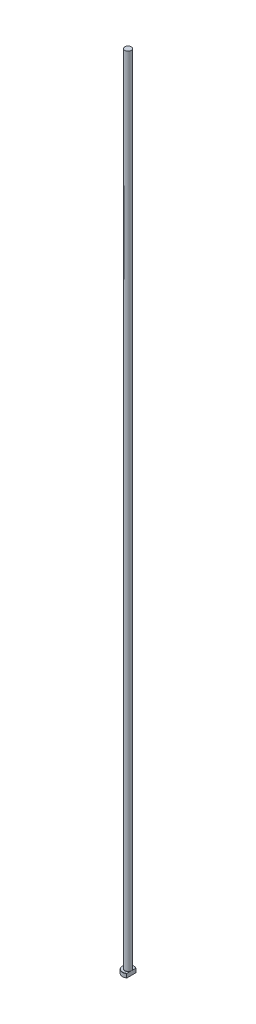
ISO-10303-21;
HEADER;
FILE_DESCRIPTION(('STEP AP214'),'2;1');
FILE_NAME('part.step','',(''),(''),'','','');
FILE_SCHEMA(('AUTOMOTIVE_DESIGN { 1 0 10303 214 1 1 1 1 }'));
ENDSEC;
DATA;
#1=APPLICATION_CONTEXT('core data for automotive mechanical design processes');
#2=APPLICATION_PROTOCOL_DEFINITION('international standard','automotive_design',2000,#1);
#3=PRODUCT_CONTEXT('',#1,'mechanical');
#4=PRODUCT('Part','Part','',(#3));
#5=PRODUCT_RELATED_PRODUCT_CATEGORY('part','',(#4));
#6=PRODUCT_DEFINITION_FORMATION('','',#4);
#7=PRODUCT_DEFINITION_CONTEXT('part definition',#1,'design');
#8=PRODUCT_DEFINITION('design','',#6,#7);
#9=PRODUCT_DEFINITION_SHAPE('','',#8);
#10=(LENGTH_UNIT() NAMED_UNIT(*) SI_UNIT(.MILLI.,.METRE.));
#11=(NAMED_UNIT(*) PLANE_ANGLE_UNIT() SI_UNIT($,.RADIAN.));
#12=(NAMED_UNIT(*) SI_UNIT($,.STERADIAN.) SOLID_ANGLE_UNIT());
#13=UNCERTAINTY_MEASURE_WITH_UNIT(LENGTH_MEASURE(1.E-05),#10,'distance_accuracy_value','');
#14=(GEOMETRIC_REPRESENTATION_CONTEXT(3) GLOBAL_UNCERTAINTY_ASSIGNED_CONTEXT((#13)) GLOBAL_UNIT_ASSIGNED_CONTEXT((#10,
#11,#12)) REPRESENTATION_CONTEXT('',''));
#15=CARTESIAN_POINT('',(0.,0.,0.));
#16=DIRECTION('',(0.,0.,1.));
#17=DIRECTION('',(1.,0.,0.));
#18=AXIS2_PLACEMENT_3D('',#15,#16,#17);
#19=CARTESIAN_POINT('',(0.,0.,0.));
#20=DIRECTION('',(0.,-1.,0.));
#21=DIRECTION('',(0.,0.,-1.));
#22=AXIS2_PLACEMENT_3D('',#19,#20,#21);
#23=PLANE('',#22);
#24=CARTESIAN_POINT('',(0.,0.,0.));
#25=DIRECTION('',(0.,-1.,0.));
#26=DIRECTION('',(0.,0.,-1.));
#27=AXIS2_PLACEMENT_3D('',#24,#25,#26);
#28=CIRCLE('',#27,6.79999999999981);
#29=CARTESIAN_POINT('',(3.99999999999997,0.,5.49909083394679));
#30=VERTEX_POINT('',#29);
#31=CARTESIAN_POINT('',(3.99999999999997,0.,-5.49909083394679));
#32=VERTEX_POINT('',#31);
#33=EDGE_CURVE('E98',#30,#32,#28,.T.);
#34=ORIENTED_EDGE('',*,*,#33,.T.);
#35=DIRECTION('',(0.,0.,1.));
#36=VECTOR('',#35,1.);
#37=CARTESIAN_POINT('',(3.99999999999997,0.,-5.74456264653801));
#38=LINE('',#37,#36);
#39=EDGE_CURVE('E83',#32,#30,#38,.T.);
#40=ORIENTED_EDGE('',*,*,#39,.T.);
#41=EDGE_LOOP('',(#34,#40));
#42=FACE_BOUND('',#41,.T.);
#43=ADVANCED_FACE('F32',(#42),#23,.T.);
#44=CARTESIAN_POINT('',(0.,259.958771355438,0.));
#45=DIRECTION('',(0.,1.,0.));
#46=DIRECTION('',(0.,0.,1.));
#47=AXIS2_PLACEMENT_3D('',#44,#45,#46);
#48=CYLINDRICAL_SURFACE('',#47,6.99999999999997);
#49=CARTESIAN_POINT('',(0.,4.80000000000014,0.));
#50=DIRECTION('',(0.,1.,0.));
#51=DIRECTION('',(0.,0.,1.));
#52=AXIS2_PLACEMENT_3D('',#49,#50,#51);
#53=CIRCLE('',#52,6.99999999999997);
#54=CARTESIAN_POINT('',(3.99999999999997,4.80000000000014,5.74456264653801));
#55=VERTEX_POINT('',#54);
#56=CARTESIAN_POINT('',(3.99999999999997,4.80000000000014,-5.74456264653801));
#57=VERTEX_POINT('',#56);
#58=EDGE_CURVE('E104',#55,#57,#53,.F.);
#59=ORIENTED_EDGE('',*,*,#58,.T.);
#60=DIRECTION('',(0.,-1.,0.));
#61=VECTOR('',#60,1.);
#62=CARTESIAN_POINT('',(3.99999999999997,1000.,-5.74456264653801));
#63=LINE('',#62,#61);
#64=CARTESIAN_POINT('',(3.99999999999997,0.200000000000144,-5.74456264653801));
#65=VERTEX_POINT('',#64);
#66=EDGE_CURVE('E183',#57,#65,#63,.T.);
#67=ORIENTED_EDGE('',*,*,#66,.T.);
#68=CARTESIAN_POINT('',(0.,0.200000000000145,0.));
#69=DIRECTION('',(0.,-1.,0.));
#70=DIRECTION('',(0.,0.,-1.));
#71=AXIS2_PLACEMENT_3D('',#68,#69,#70);
#72=CIRCLE('',#71,6.99999999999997);
#73=CARTESIAN_POINT('',(3.99999999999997,0.200000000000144,5.74456264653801));
#74=VERTEX_POINT('',#73);
#75=EDGE_CURVE('E100',#65,#74,#72,.F.);
#76=ORIENTED_EDGE('',*,*,#75,.T.);
#77=DIRECTION('',(0.,-1.,0.));
#78=VECTOR('',#77,1.);
#79=CARTESIAN_POINT('',(3.99999999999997,1000.,5.74456264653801));
#80=LINE('',#79,#78);
#81=EDGE_CURVE('E93',#55,#74,#80,.T.);
#82=ORIENTED_EDGE('',*,*,#81,.F.);
#83=EDGE_LOOP('',(#59,#67,#76,#82));
#84=FACE_BOUND('',#83,.T.);
#85=ADVANCED_FACE('F158',(#84),#48,.T.);
#86=CARTESIAN_POINT('',(-6.99999999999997,5.,0.));
#87=DIRECTION('',(0.,1.,0.));
#88=DIRECTION('',(0.,0.,1.));
#89=AXIS2_PLACEMENT_3D('',#86,#87,#88);
#90=PLANE('',#89);
#91=CARTESIAN_POINT('',(0.,5.,0.));
#92=DIRECTION('',(0.,1.,0.));
#93=DIRECTION('',(0.,0.,1.));
#94=AXIS2_PLACEMENT_3D('',#91,#92,#93);
#95=CIRCLE('',#94,6.80000000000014);
#96=CARTESIAN_POINT('',(3.99999999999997,5.,-5.49909083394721));
#97=VERTEX_POINT('',#96);
#98=CARTESIAN_POINT('',(3.99999999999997,5.,5.49909083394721));
#99=VERTEX_POINT('',#98);
#100=EDGE_CURVE('E178',#97,#99,#95,.T.);
#101=ORIENTED_EDGE('',*,*,#100,.T.);
#102=DIRECTION('',(0.,0.,-1.));
#103=VECTOR('',#102,1.);
#104=CARTESIAN_POINT('',(3.99999999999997,5.,0.));
#105=LINE('',#104,#103);
#106=CARTESIAN_POINT('',(3.99999999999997,4.99999999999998,1.28062484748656));
#107=VERTEX_POINT('',#106);
#108=EDGE_CURVE('E57',#99,#107,#105,.T.);
#109=ORIENTED_EDGE('',*,*,#108,.T.);
#110=CARTESIAN_POINT('',(0.,5.,0.));
#111=DIRECTION('',(0.,1.,0.));
#112=DIRECTION('',(0.,0.,1.));
#113=AXIS2_PLACEMENT_3D('',#110,#111,#112);
#114=CIRCLE('',#113,4.19999999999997);
#115=CARTESIAN_POINT('',(3.99999999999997,4.99999999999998,-1.28062484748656));
#116=VERTEX_POINT('',#115);
#117=EDGE_CURVE('E107',#107,#116,#114,.F.);
#118=ORIENTED_EDGE('',*,*,#117,.T.);
#119=EDGE_CURVE('E136',#116,#97,#105,.T.);
#120=ORIENTED_EDGE('',*,*,#119,.T.);
#121=EDGE_LOOP('',(#101,#109,#118,#120));
#122=FACE_BOUND('',#121,.T.);
#123=ADVANCED_FACE('F147',(#122),#90,.T.);
#124=CARTESIAN_POINT('',(0.,5.,0.));
#125=DIRECTION('',(0.,-1.,0.));
#126=DIRECTION('',(0.,0.,-1.));
#127=AXIS2_PLACEMENT_3D('',#124,#125,#126);
#128=CONICAL_SURFACE('',#127,6.80000000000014,0.785398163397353);
#129=ORIENTED_EDGE('',*,*,#58,.F.);
#130=CARTESIAN_POINT('',(3.99999999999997,-1.45712845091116,12.6392822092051));
#131=CARTESIAN_POINT('',(3.99999999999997,-1.24364466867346,12.4153556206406));
#132=CARTESIAN_POINT('',(3.99999999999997,-1.0304243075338,12.1911774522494));
#133=CARTESIAN_POINT('',(3.99999999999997,-0.604617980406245,11.7422167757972));
#134=CARTESIAN_POINT('',(3.99999999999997,-0.392032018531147,11.5174342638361));
#135=CARTESIAN_POINT('',(3.99999999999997,0.032462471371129,11.0670952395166));
#136=CARTESIAN_POINT('',(3.99999999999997,0.244370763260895,10.8415385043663));
#137=CARTESIAN_POINT('',(3.99999999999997,0.667290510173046,10.3895875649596));
#138=CARTESIAN_POINT('',(3.99999999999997,0.878301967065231,10.1631933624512));
#139=CARTESIAN_POINT('',(3.99999999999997,1.51385375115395,9.47810122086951));
#140=CARTESIAN_POINT('',(3.99999999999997,1.936762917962,9.01788214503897));
#141=CARTESIAN_POINT('',(3.99999999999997,2.56612335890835,8.32309905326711));
#142=CARTESIAN_POINT('',(3.99999999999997,2.77505666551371,8.09078457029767));
#143=CARTESIAN_POINT('',(3.99999999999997,3.1908025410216,7.62426940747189));
#144=CARTESIAN_POINT('',(3.99999999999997,3.39761512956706,7.39006874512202));
#145=CARTESIAN_POINT('',(3.99999999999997,3.87870763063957,6.83891844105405));
#146=CARTESIAN_POINT('',(3.99999999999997,4.15190978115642,6.52102188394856));
#147=CARTESIAN_POINT('',(3.99999999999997,4.5564242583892,6.0396090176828));
#148=CARTESIAN_POINT('',(3.99999999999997,4.69041050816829,5.87833992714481));
#149=CARTESIAN_POINT('',(3.99999999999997,4.95616531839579,5.55398469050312));
#150=CARTESIAN_POINT('',(3.99999999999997,5.08793391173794,5.39089857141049));
#151=CARTESIAN_POINT('',(3.99999999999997,5.34841712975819,5.0628880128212));
#152=CARTESIAN_POINT('',(3.99999999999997,5.47713786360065,4.89796843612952));
#153=CARTESIAN_POINT('',(3.99999999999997,5.73107494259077,4.56545535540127));
#154=CARTESIAN_POINT('',(3.99999999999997,5.85629144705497,4.39786197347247));
#155=CARTESIAN_POINT('',(3.99999999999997,6.10211465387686,4.05948444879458));
#156=CARTESIAN_POINT('',(3.99999999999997,6.22272435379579,3.8887024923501));
#157=CARTESIAN_POINT('',(3.99999999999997,6.45796076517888,3.54308312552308));
#158=CARTESIAN_POINT('',(3.99999999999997,6.57258867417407,3.36824653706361));
#159=CARTESIAN_POINT('',(3.99999999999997,6.76866603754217,3.05381396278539));
#160=CARTESIAN_POINT('',(3.99999999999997,6.85173773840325,2.91523359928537));
#161=CARTESIAN_POINT('',(3.99999999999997,7.01174537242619,2.63451965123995));
#162=CARTESIAN_POINT('',(3.99999999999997,7.0886804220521,2.49238555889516));
#163=CARTESIAN_POINT('',(3.99999999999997,7.23459437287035,2.20416961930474));
#164=CARTESIAN_POINT('',(3.99999999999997,7.3035783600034,2.0580903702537));
#165=CARTESIAN_POINT('',(3.99999999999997,7.43135520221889,1.76151732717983));
#166=CARTESIAN_POINT('',(3.99999999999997,7.49015114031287,1.6110248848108));
#167=CARTESIAN_POINT('',(3.99999999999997,7.58249315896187,1.34142099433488));
#168=CARTESIAN_POINT('',(3.99999999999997,7.61872660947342,1.22323501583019));
#169=CARTESIAN_POINT('',(3.99999999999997,7.6822335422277,0.984492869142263));
#170=CARTESIAN_POINT('',(3.99999999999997,7.70951040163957,0.863937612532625));
#171=CARTESIAN_POINT('',(3.99999999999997,7.75377914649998,0.621342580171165));
#172=CARTESIAN_POINT('',(3.99999999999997,7.77080509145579,0.499309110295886));
#173=CARTESIAN_POINT('',(3.99999999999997,7.79378778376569,0.254194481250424));
#174=CARTESIAN_POINT('',(3.99999999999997,7.79974523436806,0.131113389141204));
#175=CARTESIAN_POINT('',(3.99999999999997,7.8002395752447,-0.1155172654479));
#176=CARTESIAN_POINT('',(3.99999999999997,7.79473514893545,-0.239066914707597));
#177=CARTESIAN_POINT('',(3.99999999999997,7.77255119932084,-0.485148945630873));
#178=CARTESIAN_POINT('',(3.99999999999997,7.75587091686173,-0.607681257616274));
#179=CARTESIAN_POINT('',(3.99999999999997,7.71218353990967,-0.851269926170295));
#180=CARTESIAN_POINT('',(3.99999999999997,7.68514362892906,-0.972320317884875));
#181=CARTESIAN_POINT('',(3.99999999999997,7.62201202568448,-1.21200276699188));
#182=CARTESIAN_POINT('',(3.99999999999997,7.58591962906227,-1.33063463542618));
#183=CARTESIAN_POINT('',(3.99999999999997,7.4598007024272,-1.70122439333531));
#184=CARTESIAN_POINT('',(3.99999999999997,7.35572950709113,-1.94843335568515));
#185=CARTESIAN_POINT('',(3.99999999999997,7.18186715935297,-2.31048534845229));
#186=CARTESIAN_POINT('',(3.99999999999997,7.12087684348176,-2.42983561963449));
#187=CARTESIAN_POINT('',(3.99999999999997,6.99403531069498,-2.66593629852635));
#188=CARTESIAN_POINT('',(3.99999999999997,6.92818466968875,-2.78268701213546));
#189=CARTESIAN_POINT('',(3.99999999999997,6.79157875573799,-3.01550895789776));
#190=CARTESIAN_POINT('',(3.99999999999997,6.72076681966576,-3.13154660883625));
#191=CARTESIAN_POINT('',(3.99999999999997,6.57583116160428,-3.36153379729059));
#192=CARTESIAN_POINT('',(3.99999999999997,6.50170736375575,-3.47548328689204));
#193=CARTESIAN_POINT('',(3.99999999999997,6.35080982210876,-3.70145107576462));
#194=CARTESIAN_POINT('',(3.99999999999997,6.27403866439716,-3.81347110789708));
#195=CARTESIAN_POINT('',(3.99999999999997,6.11824120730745,-4.03592316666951));
#196=CARTESIAN_POINT('',(3.99999999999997,6.03921496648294,-4.14635523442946));
#197=CARTESIAN_POINT('',(3.99999999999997,5.81506547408,-4.45397159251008));
#198=CARTESIAN_POINT('',(3.99999999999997,5.66782256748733,-4.64961120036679));
#199=CARTESIAN_POINT('',(3.99999999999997,5.36880597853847,-5.03740600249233));
#200=CARTESIAN_POINT('',(3.99999999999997,5.21703183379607,-5.22956083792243));
#201=CARTESIAN_POINT('',(3.99999999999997,4.9099910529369,-5.61115465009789));
#202=CARTESIAN_POINT('',(3.99999999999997,4.75472331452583,-5.80059273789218));
#203=CARTESIAN_POINT('',(3.99999999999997,4.44150758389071,-6.17724364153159));
#204=CARTESIAN_POINT('',(3.99999999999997,4.28355951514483,-6.36445639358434));
#205=CARTESIAN_POINT('',(3.99999999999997,3.96525805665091,-6.73740614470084));
#206=CARTESIAN_POINT('',(3.99999999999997,3.8049008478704,-6.92313987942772));
#207=CARTESIAN_POINT('',(3.99999999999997,3.48247055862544,-7.29311320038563));
#208=CARTESIAN_POINT('',(3.99999999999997,3.32039746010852,-7.47735277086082));
#209=CARTESIAN_POINT('',(3.99999999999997,2.83216188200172,-8.02814826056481));
#210=CARTESIAN_POINT('',(3.99999999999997,2.50391696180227,-8.39285790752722));
#211=CARTESIAN_POINT('',(3.99999999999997,1.87512078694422,-9.08414492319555));
#212=CARTESIAN_POINT('',(3.99999999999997,1.57491666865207,-9.41103929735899));
#213=CARTESIAN_POINT('',(3.99999999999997,0.972153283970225,-10.0626830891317));
#214=CARTESIAN_POINT('',(3.99999999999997,0.669593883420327,-10.3874323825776));
#215=CARTESIAN_POINT('',(3.99999999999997,0.0637759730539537,-11.0341169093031));
#216=CARTESIAN_POINT('',(3.99999999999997,-0.239476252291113,-11.3560580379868));
#217=CARTESIAN_POINT('',(3.99999999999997,-0.847356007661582,-11.9985921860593));
#218=CARTESIAN_POINT('',(3.99999999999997,-1.15198342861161,-12.3191853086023));
#219=CARTESIAN_POINT('',(3.99999999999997,-1.45712845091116,-12.6392822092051));
#220=B_SPLINE_CURVE_WITH_KNOTS('',3,(#130,#131,#132,#133,#134,#135,#136,#137,#138,#139,#140,
#141,#142,#143,#144,#145,#146,#147,#148,#149,#150,#151,#152,#153,#154,#155,#156,#157,#158,#159,
#160,#161,#162,#163,#164,#165,#166,#167,#168,#169,#170,#171,#172,#173,#174,#175,#176,#177,#178,
#179,#180,#181,#182,#183,#184,#185,#186,#187,#188,#189,#190,#191,#192,#193,#194,#195,#196,#197,
#198,#199,#200,#201,#202,#203,#204,#205,#206,#207,#208,#209,#210,#211,#212,#213,#214,#215,#216,
#217,#218,#219),.UNSPECIFIED.,.F.,.F.,(4,2,2,2,2,2,2,2,2,2,2,2,2,2,2,2,2,2,2,2,2,2,2,2,2,2,2,2,
2,2,2,2,2,2,2,2,2,2,2,2,2,2,2,2,4),(0.,0.928152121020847,1.85631024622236,2.78476262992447,
3.71321307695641,5.58823033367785,6.52556078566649,7.46288254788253,8.72028576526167,
9.34927045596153,9.97824580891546,10.6058302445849,11.2333861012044,11.860526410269,
12.4875406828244,12.972136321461,13.4568016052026,13.9411551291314,14.4253618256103,
14.7959147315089,15.1663277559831,15.5355031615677,15.9046551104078,16.2751400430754,
16.6456501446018,17.0173437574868,17.3890663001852,18.1913996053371,18.5934522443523,
18.9954573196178,19.4032100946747,19.8109722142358,20.218346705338,20.6257106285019,
21.3601838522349,22.0947322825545,22.8295158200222,23.5643203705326,24.3004480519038,
25.0365834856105,26.5085499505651,27.8400191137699,29.1715646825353,30.4983881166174,
31.825108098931),.UNSPECIFIED.);
#221=EDGE_CURVE('E135',#55,#99,#220,.T.);
#222=ORIENTED_EDGE('',*,*,#221,.T.);
#223=ORIENTED_EDGE('',*,*,#100,.F.);
#224=EDGE_CURVE('E127',#97,#57,#220,.T.);
#225=ORIENTED_EDGE('',*,*,#224,.T.);
#226=EDGE_LOOP('',(#129,#222,#223,#225));
#227=FACE_BOUND('',#226,.T.);
#228=ADVANCED_FACE('F143',(#227),#128,.T.);
#229=CARTESIAN_POINT('',(0.,0.200000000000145,0.));
#230=DIRECTION('',(0.,1.,0.));
#231=DIRECTION('',(0.,0.,1.));
#232=AXIS2_PLACEMENT_3D('',#229,#230,#231);
#233=CONICAL_SURFACE('',#232,6.99999999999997,0.785398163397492);
#234=ORIENTED_EDGE('',*,*,#75,.F.);
#235=CARTESIAN_POINT('',(3.99999999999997,6.4571284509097,-12.6392822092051));
#236=CARTESIAN_POINT('',(3.99999999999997,6.24364466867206,-12.4153556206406));
#237=CARTESIAN_POINT('',(3.99999999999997,6.03042430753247,-12.1911774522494));
#238=CARTESIAN_POINT('',(3.99999999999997,5.60461798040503,-11.7422167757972));
#239=CARTESIAN_POINT('',(3.99999999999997,5.39203201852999,-11.5174342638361));
#240=CARTESIAN_POINT('',(3.99999999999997,4.96753752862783,-11.0670952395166));
#241=CARTESIAN_POINT('',(3.99999999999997,4.75562923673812,-10.8415385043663));
#242=CARTESIAN_POINT('',(3.99999999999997,4.33270948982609,-10.3895875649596));
#243=CARTESIAN_POINT('',(3.99999999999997,4.12169803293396,-10.1631933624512));
#244=CARTESIAN_POINT('',(3.99999999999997,3.48614624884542,-9.47810122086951));
#245=CARTESIAN_POINT('',(3.99999999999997,3.06323708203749,-9.01788214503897));
#246=CARTESIAN_POINT('',(3.99999999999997,2.43387664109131,-8.32309905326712));
#247=CARTESIAN_POINT('',(3.99999999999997,2.22494333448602,-8.09078457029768));
#248=CARTESIAN_POINT('',(3.99999999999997,1.80919745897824,-7.6242694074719));
#249=CARTESIAN_POINT('',(3.99999999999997,1.60238487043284,-7.39006874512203));
#250=CARTESIAN_POINT('',(3.99999999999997,1.12129236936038,-6.83891844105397));
#251=CARTESIAN_POINT('',(3.99999999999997,0.848090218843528,-6.52102188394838));
#252=CARTESIAN_POINT('',(3.99999999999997,0.443575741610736,-6.03960901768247));
#253=CARTESIAN_POINT('',(3.99999999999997,0.309589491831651,-5.87833992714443));
#254=CARTESIAN_POINT('',(3.99999999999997,0.0438346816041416,-5.55398469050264));
#255=CARTESIAN_POINT('',(3.99999999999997,-0.0879339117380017,-5.39089857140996));
#256=CARTESIAN_POINT('',(3.99999999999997,-0.348417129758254,-5.06288801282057));
#257=CARTESIAN_POINT('',(3.99999999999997,-0.477137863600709,-4.89796843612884));
#258=CARTESIAN_POINT('',(3.99999999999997,-0.731074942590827,-4.56545535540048));
#259=CARTESIAN_POINT('',(3.99999999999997,-0.856291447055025,-4.39786197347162));
#260=CARTESIAN_POINT('',(3.99999999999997,-1.10211465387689,-4.05948444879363));
#261=CARTESIAN_POINT('',(3.99999999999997,-1.22272435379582,-3.8887024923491));
#262=CARTESIAN_POINT('',(3.99999999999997,-1.45796076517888,-3.54308312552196));
#263=CARTESIAN_POINT('',(3.99999999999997,-1.57258867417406,-3.36824653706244));
#264=CARTESIAN_POINT('',(3.99999999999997,-1.76866603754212,-3.05381396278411));
#265=CARTESIAN_POINT('',(3.99999999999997,-1.85173773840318,-2.91523359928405));
#266=CARTESIAN_POINT('',(3.99999999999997,-2.01174537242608,-2.63451965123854));
#267=CARTESIAN_POINT('',(3.99999999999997,-2.08868042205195,-2.4923855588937));
#268=CARTESIAN_POINT('',(3.99999999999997,-2.23459437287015,-2.20416961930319));
#269=CARTESIAN_POINT('',(3.99999999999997,-2.30357836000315,-2.05809037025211));
#270=CARTESIAN_POINT('',(3.99999999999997,-2.43135520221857,-1.76151732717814));
#271=CARTESIAN_POINT('',(3.99999999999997,-2.49015114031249,-1.61102488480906));
#272=CARTESIAN_POINT('',(3.99999999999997,-2.58249315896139,-1.34142099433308));
#273=CARTESIAN_POINT('',(3.99999999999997,-2.61872660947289,-1.22323501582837));
#274=CARTESIAN_POINT('',(3.99999999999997,-2.68223354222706,-0.984492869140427));
#275=CARTESIAN_POINT('',(3.99999999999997,-2.70951040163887,-0.863937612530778));
#276=CARTESIAN_POINT('',(3.99999999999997,-2.75377914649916,-0.621342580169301));
#277=CARTESIAN_POINT('',(3.99999999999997,-2.77080509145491,-0.499309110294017));
#278=CARTESIAN_POINT('',(3.99999999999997,-2.7937877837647,-0.254194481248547));
#279=CARTESIAN_POINT('',(3.99999999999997,-2.79974523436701,-0.131113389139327));
#280=CARTESIAN_POINT('',(3.99999999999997,-2.80023957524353,0.115517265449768));
#281=CARTESIAN_POINT('',(3.99999999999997,-2.79473514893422,0.239066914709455));
#282=CARTESIAN_POINT('',(3.99999999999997,-2.77255119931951,0.485148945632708));
#283=CARTESIAN_POINT('',(3.99999999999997,-2.75587091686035,0.607681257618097));
#284=CARTESIAN_POINT('',(3.99999999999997,-2.71218353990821,0.851269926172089));
#285=CARTESIAN_POINT('',(3.99999999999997,-2.68514362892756,0.972320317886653));
#286=CARTESIAN_POINT('',(3.99999999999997,-2.62201202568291,1.21200276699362));
#287=CARTESIAN_POINT('',(3.99999999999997,-2.58591962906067,1.33063463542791));
#288=CARTESIAN_POINT('',(3.99999999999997,-2.45980070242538,1.70122439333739));
#289=CARTESIAN_POINT('',(3.99999999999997,-2.3557295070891,1.94843335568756));
#290=CARTESIAN_POINT('',(3.99999999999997,-2.18186715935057,2.31048534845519));
#291=CARTESIAN_POINT('',(3.99999999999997,-2.12087684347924,2.42983561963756));
#292=CARTESIAN_POINT('',(3.99999999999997,-1.99403531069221,2.66593629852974));
#293=CARTESIAN_POINT('',(3.99999999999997,-1.92818466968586,2.78268701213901));
#294=CARTESIAN_POINT('',(3.99999999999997,-1.79157875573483,3.01550895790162));
#295=CARTESIAN_POINT('',(3.99999999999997,-1.72076681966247,3.13154660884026));
#296=CARTESIAN_POINT('',(3.99999999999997,-1.57583116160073,3.36153379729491));
#297=CARTESIAN_POINT('',(3.99999999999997,-1.50170736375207,3.47548328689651));
#298=CARTESIAN_POINT('',(3.99999999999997,-1.3508098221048,3.7014510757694));
#299=CARTESIAN_POINT('',(3.99999999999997,-1.27403866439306,3.81347110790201));
#300=CARTESIAN_POINT('',(3.99999999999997,-1.11824120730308,4.03592316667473));
#301=CARTESIAN_POINT('',(3.99999999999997,-1.03921496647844,4.14635523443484));
#302=CARTESIAN_POINT('',(3.99999999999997,-0.815065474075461,4.45397159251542));
#303=CARTESIAN_POINT('',(3.99999999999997,-0.667822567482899,4.64961120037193));
#304=CARTESIAN_POINT('',(3.99999999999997,-0.368805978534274,5.03740600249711));
#305=CARTESIAN_POINT('',(3.99999999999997,-0.217031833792,5.22956083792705));
#306=CARTESIAN_POINT('',(3.99999999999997,0.0900089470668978,5.61115465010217));
#307=CARTESIAN_POINT('',(3.99999999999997,0.245276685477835,5.8005927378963));
#308=CARTESIAN_POINT('',(3.99999999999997,0.558492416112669,6.17724364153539));
#309=CARTESIAN_POINT('',(3.99999999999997,0.716440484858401,6.36445639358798));
#310=CARTESIAN_POINT('',(3.99999999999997,1.03474194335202,6.73740614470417));
#311=CARTESIAN_POINT('',(3.99999999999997,1.19509915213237,6.92313987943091));
#312=CARTESIAN_POINT('',(3.99999999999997,1.51752944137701,7.29311320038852));
#313=CARTESIAN_POINT('',(3.99999999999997,1.67960253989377,7.47735277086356));
#314=CARTESIAN_POINT('',(3.99999999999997,2.16783811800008,8.02814826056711));
#315=CARTESIAN_POINT('',(3.99999999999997,2.4960830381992,8.39285790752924));
#316=CARTESIAN_POINT('',(3.99999999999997,3.1248792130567,9.08414492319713));
#317=CARTESIAN_POINT('',(3.99999999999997,3.42508333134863,9.41103929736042));
#318=CARTESIAN_POINT('',(3.99999999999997,4.02784671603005,10.0626830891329));
#319=CARTESIAN_POINT('',(3.99999999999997,4.33040611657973,10.3874323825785));
#320=CARTESIAN_POINT('',(3.99999999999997,4.93622402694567,11.0341169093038));
#321=CARTESIAN_POINT('',(3.99999999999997,5.23947625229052,11.3560580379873));
#322=CARTESIAN_POINT('',(3.99999999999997,5.84735600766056,11.9985921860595));
#323=CARTESIAN_POINT('',(3.99999999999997,6.15198342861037,12.3191853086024));
#324=CARTESIAN_POINT('',(3.99999999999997,6.4571284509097,12.6392822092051));
#325=B_SPLINE_CURVE_WITH_KNOTS('',3,(#235,#236,#237,#238,#239,#240,#241,#242,#243,#244,#245,
#246,#247,#248,#249,#250,#251,#252,#253,#254,#255,#256,#257,#258,#259,#260,#261,#262,#263,#264,
#265,#266,#267,#268,#269,#270,#271,#272,#273,#274,#275,#276,#277,#278,#279,#280,#281,#282,#283,
#284,#285,#286,#287,#288,#289,#290,#291,#292,#293,#294,#295,#296,#297,#298,#299,#300,#301,#302,
#303,#304,#305,#306,#307,#308,#309,#310,#311,#312,#313,#314,#315,#316,#317,#318,#319,#320,#321,
#322,#323,#324),.UNSPECIFIED.,.F.,.F.,(4,2,2,2,2,2,2,2,2,2,2,2,2,2,2,2,2,2,2,2,2,2,2,2,2,2,2,2,
2,2,2,2,2,2,2,2,2,2,2,2,2,2,2,2,4),(0.,0.928152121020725,1.85631024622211,2.78476262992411,
3.71321307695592,5.58823033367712,6.52556078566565,7.46288254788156,8.72028576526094,
9.34927045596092,9.97824580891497,10.6058302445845,11.2333861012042,11.8605264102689,
12.4875406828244,12.972136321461,13.4568016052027,13.9411551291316,14.4253618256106,
14.7959147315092,15.1663277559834,15.535503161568,15.9046551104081,16.2751400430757,
16.645650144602,17.017343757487,17.3890663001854,18.1913996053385,18.5934522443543,
18.9954573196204,19.4032100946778,19.8109722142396,20.2183467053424,20.6257106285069,
21.3601838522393,22.0947322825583,22.8295158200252,23.564320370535,24.3004480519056,
25.0365834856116,26.508549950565,27.8400191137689,29.1715646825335,30.4983881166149,
31.8251080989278),.UNSPECIFIED.);
#326=EDGE_CURVE('E86',#65,#32,#325,.T.);
#327=ORIENTED_EDGE('',*,*,#326,.T.);
#328=ORIENTED_EDGE('',*,*,#33,.F.);
#329=EDGE_CURVE('E89',#30,#74,#325,.T.);
#330=ORIENTED_EDGE('',*,*,#329,.T.);
#331=EDGE_LOOP('',(#234,#327,#328,#330));
#332=FACE_BOUND('',#331,.T.);
#333=ADVANCED_FACE('F97',(#332),#233,.T.);
#334=CARTESIAN_POINT('',(0.,5.19999999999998,0.));
#335=DIRECTION('',(0.,1.,0.));
#336=DIRECTION('',(0.,0.,1.));
#337=AXIS2_PLACEMENT_3D('',#334,#335,#336);
#338=TOROIDAL_SURFACE('',#337,4.19999999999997,0.2);
#339=CARTESIAN_POINT('',(3.99999999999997,5.19999999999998,0.));
#340=CARTESIAN_POINT('',(3.99999999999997,5.20000051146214,6.55036346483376E-12));
#341=CARTESIAN_POINT('',(3.99999999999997,5.20000102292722,-2.33849506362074E-07));
#342=CARTESIAN_POINT('',(3.99999999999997,5.20000197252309,-8.59106878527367E-07));
#343=CARTESIAN_POINT('',(3.99999999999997,5.20000239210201,-1.26721104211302E-06));
#344=CARTESIAN_POINT('',(3.99999999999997,5.2000032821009,-2.25074272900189E-06));
#345=CARTESIAN_POINT('',(3.99999999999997,5.20000373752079,-2.84212509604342E-06));
#346=CARTESIAN_POINT('',(3.99999999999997,5.20000453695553,-4.0532804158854E-06));
#347=CARTESIAN_POINT('',(3.99999999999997,5.20000488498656,-4.67066373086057E-06));
#348=CARTESIAN_POINT('',(3.99999999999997,5.20000621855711,-7.11716595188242E-06));
#349=CARTESIAN_POINT('',(3.99999999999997,5.20000713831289,-8.9855846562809E-06));
#350=CARTESIAN_POINT('',(3.99999999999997,5.20000861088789,-1.26418241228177E-05));
#351=CARTESIAN_POINT('',(3.99999999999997,5.20000919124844,-1.44189478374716E-05));
#352=CARTESIAN_POINT('',(3.99999999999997,5.20001169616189,-2.20915834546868E-05));
#353=CARTESIAN_POINT('',(3.99999999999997,5.20001361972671,-2.79894745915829E-05));
#354=CARTESIAN_POINT('',(3.99999999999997,5.20001638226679,-3.90228530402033E-05));
#355=CARTESIAN_POINT('',(3.99999999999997,5.20001734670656,-4.41264575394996E-05));
#356=CARTESIAN_POINT('',(3.99999999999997,5.20002447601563,-8.24800894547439E-05));
#357=CARTESIAN_POINT('',(3.99999999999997,5.20003000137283,-0.000115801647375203));
#358=CARTESIAN_POINT('',(3.99999999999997,5.20005417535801,-0.000248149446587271));
#359=CARTESIAN_POINT('',(3.99999999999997,5.20007711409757,-0.00034639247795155));
#360=CARTESIAN_POINT('',(3.99999999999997,5.20016695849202,-0.000737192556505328));
#361=CARTESIAN_POINT('',(3.99999999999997,5.2002311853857,-0.00103015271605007));
#362=CARTESIAN_POINT('',(3.99999999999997,5.20048943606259,-0.00220000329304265));
#363=CARTESIAN_POINT('',(3.99999999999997,5.20068689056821,-0.00307635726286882));
#364=CARTESIAN_POINT('',(3.99999999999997,5.2015124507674,-0.00674945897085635));
#365=CARTESIAN_POINT('',(3.99999999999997,5.20213623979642,-0.00954688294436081));
#366=CARTESIAN_POINT('',(3.99999999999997,5.21069858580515,-0.0479346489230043));
#367=CARTESIAN_POINT('',(3.99999999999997,5.21866411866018,-0.083521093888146));
#368=CARTESIAN_POINT('',(3.99999999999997,5.23536251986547,-0.158673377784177));
#369=CARTESIAN_POINT('',(3.99999999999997,5.24408230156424,-0.198242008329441));
#370=CARTESIAN_POINT('',(3.99999999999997,5.25875222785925,-0.265746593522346));
#371=CARTESIAN_POINT('',(3.99999999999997,5.264760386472,-0.293669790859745));
#372=CARTESIAN_POINT('',(3.99999999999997,5.27645424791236,-0.348796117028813));
#373=CARTESIAN_POINT('',(3.99999999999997,5.2821442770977,-0.375998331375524));
#374=CARTESIAN_POINT('',(3.99999999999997,5.30043795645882,-0.465036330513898));
#375=CARTESIAN_POINT('',(3.99999999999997,5.31263876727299,-0.526956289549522));
#376=CARTESIAN_POINT('',(3.99999999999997,5.33561275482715,-0.65168218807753));
#377=CARTESIAN_POINT('',(3.99999999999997,5.34637105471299,-0.714490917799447));
#378=CARTESIAN_POINT('',(3.99999999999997,5.36658245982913,-0.846543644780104));
#379=CARTESIAN_POINT('',(3.99999999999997,5.37580902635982,-0.915823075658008));
#380=CARTESIAN_POINT('',(3.99999999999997,5.39039845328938,-1.05460878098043));
#381=CARTESIAN_POINT('',(3.99999999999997,5.39577328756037,-1.12411367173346));
#382=CARTESIAN_POINT('',(3.99999999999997,5.39959291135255,-1.22750409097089));
#383=CARTESIAN_POINT('',(3.99999999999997,5.40018074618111,-1.26130913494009));
#384=CARTESIAN_POINT('',(3.99999999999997,5.39972074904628,-1.32890426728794));
#385=CARTESIAN_POINT('',(3.99999999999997,5.39867346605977,-1.36269435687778));
#386=CARTESIAN_POINT('',(3.99999999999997,5.39455571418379,-1.42954089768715));
#387=CARTESIAN_POINT('',(3.99999999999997,5.39152235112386,-1.46259952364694));
#388=CARTESIAN_POINT('',(3.99999999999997,5.38286512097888,-1.52835908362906));
#389=CARTESIAN_POINT('',(3.99999999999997,5.37724516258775,-1.56106048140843));
#390=CARTESIAN_POINT('',(3.99999999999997,5.36402263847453,-1.61846409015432));
#391=CARTESIAN_POINT('',(3.99999999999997,5.35713757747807,-1.64332989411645));
#392=CARTESIAN_POINT('',(3.99999999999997,5.34027199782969,-1.69212725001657));
#393=CARTESIAN_POINT('',(3.99999999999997,5.33028876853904,-1.7160579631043));
#394=CARTESIAN_POINT('',(3.99999999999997,5.31168601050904,-1.75008824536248));
#395=CARTESIAN_POINT('',(3.99999999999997,5.30485398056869,-1.76115159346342));
#396=CARTESIAN_POINT('',(3.99999999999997,5.28960114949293,-1.78210611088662));
#397=CARTESIAN_POINT('',(3.99999999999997,5.28118962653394,-1.79200360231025));
#398=CARTESIAN_POINT('',(3.99999999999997,5.26737388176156,-1.80493475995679));
#399=CARTESIAN_POINT('',(3.99999999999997,5.26276322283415,-1.80881084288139));
#400=CARTESIAN_POINT('',(3.99999999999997,5.25306023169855,-1.81592390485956));
#401=CARTESIAN_POINT('',(3.99999999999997,5.24796771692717,-1.81916064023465));
#402=CARTESIAN_POINT('',(3.99999999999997,5.23724406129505,-1.82480514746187));
#403=CARTESIAN_POINT('',(3.99999999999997,5.23160666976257,-1.82720134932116));
#404=CARTESIAN_POINT('',(3.99999999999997,5.219971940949,-1.83083611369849));
#405=CARTESIAN_POINT('',(3.99999999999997,5.21397550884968,-1.83207746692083));
#406=CARTESIAN_POINT('',(3.99999999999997,5.20263132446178,-1.83315692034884));
#407=CARTESIAN_POINT('',(3.99999999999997,5.19729868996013,-1.8331541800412));
#408=CARTESIAN_POINT('',(3.99999999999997,5.18672944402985,-1.83214057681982));
#409=CARTESIAN_POINT('',(3.99999999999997,5.18149289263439,-1.83112910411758));
#410=CARTESIAN_POINT('',(3.99999999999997,5.17078487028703,-1.82806907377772));
#411=CARTESIAN_POINT('',(3.99999999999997,5.16533999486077,-1.82592931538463));
#412=CARTESIAN_POINT('',(3.99999999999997,5.1548729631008,-1.82079411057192));
#413=CARTESIAN_POINT('',(3.99999999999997,5.14985146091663,-1.81779737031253));
#414=CARTESIAN_POINT('',(3.99999999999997,5.13773920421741,-1.80942140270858));
#415=CARTESIAN_POINT('',(3.99999999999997,5.13094534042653,-1.80361715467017));
#416=CARTESIAN_POINT('',(3.99999999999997,5.11830005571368,-1.79106454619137));
#417=CARTESIAN_POINT('',(3.99999999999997,5.11245134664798,-1.78431356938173));
#418=CARTESIAN_POINT('',(3.99999999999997,5.09656788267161,-1.76377799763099));
#419=CARTESIAN_POINT('',(3.99999999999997,5.08757958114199,-1.74919341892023));
#420=CARTESIAN_POINT('',(3.99999999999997,5.07165230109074,-1.71899459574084));
#421=CARTESIAN_POINT('',(3.99999999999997,5.064716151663,-1.70337896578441));
#422=CARTESIAN_POINT('',(3.99999999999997,5.04964646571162,-1.66459665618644));
#423=CARTESIAN_POINT('',(3.99999999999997,5.04232016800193,-1.64111968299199));
#424=CARTESIAN_POINT('',(3.99999999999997,5.02986383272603,-1.59357415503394));
#425=CARTESIAN_POINT('',(3.99999999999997,5.02473853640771,-1.56950444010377));
#426=CARTESIAN_POINT('',(3.99999999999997,5.0161032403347,-1.52067485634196));
#427=CARTESIAN_POINT('',(3.99999999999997,5.01262117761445,-1.49591014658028));
#428=CARTESIAN_POINT('',(3.99999999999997,5.00704256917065,-1.44626562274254));
#429=CARTESIAN_POINT('',(3.99999999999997,5.00494421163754,-1.42138600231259));
#430=CARTESIAN_POINT('',(3.99999999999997,5.00075077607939,-1.35341124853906));
#431=CARTESIAN_POINT('',(3.99999999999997,4.99977133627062,-1.31024782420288));
#432=CARTESIAN_POINT('',(3.99999999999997,5.00031303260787,-1.22392963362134));
#433=CARTESIAN_POINT('',(3.99999999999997,5.00183577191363,-1.18077489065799));
#434=CARTESIAN_POINT('',(3.99999999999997,5.00931890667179,-1.05109835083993));
#435=CARTESIAN_POINT('',(3.99999999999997,5.01820648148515,-0.964749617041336));
#436=CARTESIAN_POINT('',(3.99999999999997,5.03989342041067,-0.800200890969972));
#437=CARTESIAN_POINT('',(3.99999999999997,5.05228816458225,-0.721941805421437));
#438=CARTESIAN_POINT('',(3.99999999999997,5.07962880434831,-0.566748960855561));
#439=CARTESIAN_POINT('',(3.99999999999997,5.09454562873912,-0.4898100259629));
#440=CARTESIAN_POINT('',(3.99999999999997,5.115946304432,-0.385191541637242));
#441=CARTESIAN_POINT('',(3.99999999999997,5.12174621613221,-0.357366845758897));
#442=CARTESIAN_POINT('',(3.99999999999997,5.13367824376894,-0.300962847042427));
#443=CARTESIAN_POINT('',(3.99999999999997,5.13981511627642,-0.272384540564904));
#444=CARTESIAN_POINT('',(3.99999999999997,5.15483459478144,-0.203169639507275));
#445=CARTESIAN_POINT('',(3.99999999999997,5.16378036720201,-0.1625469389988));
#446=CARTESIAN_POINT('',(3.99999999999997,5.18091599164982,-0.0854009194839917));
#447=CARTESIAN_POINT('',(3.99999999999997,5.18909179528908,-0.0488746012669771));
#448=CARTESIAN_POINT('',(3.99999999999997,5.19786384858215,-0.00954647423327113));
#449=CARTESIAN_POINT('',(3.99999999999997,5.19848773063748,-0.0067486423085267));
#450=CARTESIAN_POINT('',(3.99999999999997,5.19931331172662,-0.00307545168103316));
#451=CARTESIAN_POINT('',(3.99999999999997,5.19951069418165,-0.00219941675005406));
#452=CARTESIAN_POINT('',(3.99999999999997,5.19976885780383,-0.00102996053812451));
#453=CARTESIAN_POINT('',(3.99999999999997,5.199833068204,-0.000737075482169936));
#454=CARTESIAN_POINT('',(3.99999999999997,5.19992289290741,-0.00034636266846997));
#455=CARTESIAN_POINT('',(3.99999999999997,5.19994582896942,-0.000248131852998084));
#456=CARTESIAN_POINT('',(3.99999999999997,5.19997000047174,-0.000115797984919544));
#457=CARTESIAN_POINT('',(3.99999999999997,5.19997552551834,-8.24780552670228E-05));
#458=CARTESIAN_POINT('',(3.99999999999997,5.19998265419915,-4.4126093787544E-05));
#459=CARTESIAN_POINT('',(3.99999999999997,5.19998361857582,-3.90225725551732E-05));
#460=CARTESIAN_POINT('',(3.99999999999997,5.19998638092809,-2.79893703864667E-05));
#461=CARTESIAN_POINT('',(3.99999999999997,5.19998830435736,-2.20915678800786E-05));
#462=CARTESIAN_POINT('',(3.99999999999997,5.19999080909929,-1.44190255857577E-05));
#463=CARTESIAN_POINT('',(3.99999999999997,5.19999138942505,-1.26419078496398E-05));
#464=CARTESIAN_POINT('',(3.99999999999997,5.19999286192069,-8.98567517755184E-06));
#465=CARTESIAN_POINT('',(3.99999999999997,5.1999937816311,-7.1172564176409E-06));
#466=CARTESIAN_POINT('',(3.99999999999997,5.19999511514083,-4.67074826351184E-06));
#467=CARTESIAN_POINT('',(3.99999999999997,5.19999546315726,-4.05336147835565E-06));
#468=CARTESIAN_POINT('',(3.99999999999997,5.19999626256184,-2.84219658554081E-06));
#469=CARTESIAN_POINT('',(3.99999999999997,5.19999671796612,-2.25080798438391E-06));
#470=CARTESIAN_POINT('',(3.99999999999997,5.19999760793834,-1.26726200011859E-06));
#471=CARTESIAN_POINT('',(3.99999999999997,5.19999802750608,-8.59150369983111E-07));
#472=CARTESIAN_POINT('',(3.99999999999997,5.19999897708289,-2.33873741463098E-07));
#473=CARTESIAN_POINT('',(3.99999999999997,5.19999948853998,-6.55033592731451E-12));
#474=CARTESIAN_POINT('',(3.99999999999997,5.19999999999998,0.));
#475=B_SPLINE_CURVE_WITH_KNOTS('',3,(#339,#340,#341,#342,#343,#344,#345,#346,#347,#348,#349,
#350,#351,#352,#353,#354,#355,#356,#357,#358,#359,#360,#361,#362,#363,#364,#365,#366,#367,#368,
#369,#370,#371,#372,#373,#374,#375,#376,#377,#378,#379,#380,#381,#382,#383,#384,#385,#386,#387,
#388,#389,#390,#391,#392,#393,#394,#395,#396,#397,#398,#399,#400,#401,#402,#403,#404,#405,#406,
#407,#408,#409,#410,#411,#412,#413,#414,#415,#416,#417,#418,#419,#420,#421,#422,#423,#424,#425,
#426,#427,#428,#429,#430,#431,#432,#433,#434,#435,#436,#437,#438,#439,#440,#441,#442,#443,#444,
#445,#446,#447,#448,#449,#450,#451,#452,#453,#454,#455,#456,#457,#458,#459,#460,#461,#462,#463,
#464,#465,#466,#467,#468,#469,#470,#471,#472,#473,#474),.UNSPECIFIED.,.T.,.F.,(4,2,2,2,2,2,2,2,
2,2,2,2,2,2,2,2,2,2,2,2,2,2,2,2,2,2,2,2,2,2,2,2,2,2,2,2,2,2,2,2,2,2,2,2,2,2,2,2,2,2,2,2,2,2,2,2,
2,2,2,2,2,2,2,2,2,2,2,4),(0.,1.56012585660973E-06,3.32588854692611E-06,5.54921869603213E-06,
7.67484576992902E-06,1.39023138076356E-05,1.95054937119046E-05,3.80905024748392E-05,
5.36549282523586E-05,0.000155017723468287,0.000457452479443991,0.00135744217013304,
0.00405212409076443,0.0126508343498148,0.122049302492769,0.243603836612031,0.329290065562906,
0.412662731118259,0.601981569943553,0.79312323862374,1.00273287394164,1.21168803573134,
1.31308928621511,1.4144564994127,1.51398193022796,1.6133574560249,1.6906629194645,
1.76803621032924,1.8069612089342,1.84566433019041,1.8636943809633,1.88173129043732,
1.9000075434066,1.91823951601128,1.93413978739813,1.95004967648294,1.9675051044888,
1.98498702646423,2.01164257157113,2.03837328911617,2.08948035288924,2.14065754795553,
2.21426121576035,2.28802264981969,2.36299656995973,2.43787212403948,2.56728534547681,
2.69678151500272,2.95692568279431,3.19457926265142,3.42966002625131,3.51492857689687,
3.60261719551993,3.72740578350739,3.8396934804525,3.84829344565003,3.85098714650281,
3.85188690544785,3.85218930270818,3.8522906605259,3.85230622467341,3.85232480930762,
3.85233041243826,3.85233663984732,3.85233876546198,3.85234098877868,3.85234275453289,
3.85234431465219),.UNSPECIFIED.);
#476=CARTESIAN_POINT('',(3.99999999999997,5.19999999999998,0.));
#477=VERTEX_POINT('',#476);
#478=EDGE_CURVE('E11',#116,#477,#475,.T.);
#479=ORIENTED_EDGE('',*,*,#478,.F.);
#480=ORIENTED_EDGE('',*,*,#117,.F.);
#481=CARTESIAN_POINT('',(3.99999999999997,5.19999999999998,0.));
#482=CARTESIAN_POINT('',(3.99999999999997,5.19999948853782,-6.55004438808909E-12));
#483=CARTESIAN_POINT('',(3.99999999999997,5.19999897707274,2.33849506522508E-07));
#484=CARTESIAN_POINT('',(3.99999999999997,5.19999802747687,8.59106878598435E-07));
#485=CARTESIAN_POINT('',(3.99999999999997,5.19999760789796,1.26721104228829E-06));
#486=CARTESIAN_POINT('',(3.99999999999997,5.19999671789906,2.25074272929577E-06));
#487=CARTESIAN_POINT('',(3.99999999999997,5.19999626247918,2.84212509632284E-06));
#488=CARTESIAN_POINT('',(3.99999999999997,5.19999546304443,4.05328041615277E-06));
#489=CARTESIAN_POINT('',(3.99999999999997,5.1999951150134,4.67066373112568E-06));
#490=CARTESIAN_POINT('',(3.99999999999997,5.19999378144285,7.11716595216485E-06));
#491=CARTESIAN_POINT('',(3.99999999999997,5.19999286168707,8.98558465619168E-06));
#492=CARTESIAN_POINT('',(3.99999999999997,5.19999138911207,1.26418241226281E-05));
#493=CARTESIAN_POINT('',(3.99999999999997,5.19999080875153,1.44189478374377E-05));
#494=CARTESIAN_POINT('',(3.99999999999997,5.19998830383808,2.20915834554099E-05));
#495=CARTESIAN_POINT('',(3.99999999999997,5.19998638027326,2.79894745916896E-05));
#496=CARTESIAN_POINT('',(3.99999999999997,5.19998361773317,3.90228530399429E-05));
#497=CARTESIAN_POINT('',(3.99999999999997,5.19998265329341,4.41264575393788E-05));
#498=CARTESIAN_POINT('',(3.99999999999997,5.19997552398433,8.24800894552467E-05));
#499=CARTESIAN_POINT('',(3.99999999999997,5.19996999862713,0.000115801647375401));
#500=CARTESIAN_POINT('',(3.99999999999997,5.19994582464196,0.00024814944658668));
#501=CARTESIAN_POINT('',(3.99999999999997,5.1999228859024,0.000346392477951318));
#502=CARTESIAN_POINT('',(3.99999999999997,5.19983304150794,0.00073719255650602));
#503=CARTESIAN_POINT('',(3.99999999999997,5.19976881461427,0.00103015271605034));
#504=CARTESIAN_POINT('',(3.99999999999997,5.19951056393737,0.00220000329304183));
#505=CARTESIAN_POINT('',(3.99999999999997,5.19931310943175,0.00307635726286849));
#506=CARTESIAN_POINT('',(3.99999999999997,5.19848754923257,0.0067494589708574));
#507=CARTESIAN_POINT('',(3.99999999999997,5.19786376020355,0.00954688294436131));
#508=CARTESIAN_POINT('',(3.99999999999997,5.1893014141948,0.047934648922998));
#509=CARTESIAN_POINT('',(3.99999999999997,5.18133588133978,0.0835210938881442));
#510=CARTESIAN_POINT('',(3.99999999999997,5.1646374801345,0.158673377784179));
#511=CARTESIAN_POINT('',(3.99999999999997,5.15591769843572,0.198242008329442));
#512=CARTESIAN_POINT('',(3.99999999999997,5.14124777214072,0.265746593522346));
#513=CARTESIAN_POINT('',(3.99999999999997,5.13523961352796,0.293669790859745));
#514=CARTESIAN_POINT('',(3.99999999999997,5.12354575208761,0.348796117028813));
#515=CARTESIAN_POINT('',(3.99999999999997,5.11785572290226,0.375998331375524));
#516=CARTESIAN_POINT('',(3.99999999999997,5.09956204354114,0.465036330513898));
#517=CARTESIAN_POINT('',(3.99999999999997,5.08736123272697,0.526956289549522));
#518=CARTESIAN_POINT('',(3.99999999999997,5.06438724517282,0.65168218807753));
#519=CARTESIAN_POINT('',(3.99999999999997,5.05362894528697,0.714490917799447));
#520=CARTESIAN_POINT('',(3.99999999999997,5.03341754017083,0.846543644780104));
#521=CARTESIAN_POINT('',(3.99999999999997,5.02419097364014,0.915823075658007));
#522=CARTESIAN_POINT('',(3.99999999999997,5.00960154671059,1.05460878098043));
#523=CARTESIAN_POINT('',(3.99999999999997,5.0042267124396,1.12411367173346));
#524=CARTESIAN_POINT('',(3.99999999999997,5.00040708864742,1.22750409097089));
#525=CARTESIAN_POINT('',(3.99999999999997,4.99981925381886,1.26130913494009));
#526=CARTESIAN_POINT('',(3.99999999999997,5.00027925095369,1.32890426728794));
#527=CARTESIAN_POINT('',(3.99999999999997,5.0013265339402,1.36269435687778));
#528=CARTESIAN_POINT('',(3.99999999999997,5.00544428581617,1.42954089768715));
#529=CARTESIAN_POINT('',(3.99999999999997,5.00847764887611,1.46259952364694));
#530=CARTESIAN_POINT('',(3.99999999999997,5.01713487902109,1.52835908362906));
#531=CARTESIAN_POINT('',(3.99999999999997,5.02275483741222,1.56106048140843));
#532=CARTESIAN_POINT('',(3.99999999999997,5.03597736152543,1.61846409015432));
#533=CARTESIAN_POINT('',(3.99999999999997,5.04286242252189,1.64332989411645));
#534=CARTESIAN_POINT('',(3.99999999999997,5.05972800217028,1.69212725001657));
#535=CARTESIAN_POINT('',(3.99999999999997,5.06971123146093,1.7160579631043));
#536=CARTESIAN_POINT('',(3.99999999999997,5.08831398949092,1.75008824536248));
#537=CARTESIAN_POINT('',(3.99999999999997,5.09514601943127,1.76115159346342));
#538=CARTESIAN_POINT('',(3.99999999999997,5.11039885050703,1.78210611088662));
#539=CARTESIAN_POINT('',(3.99999999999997,5.11881037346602,1.79200360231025));
#540=CARTESIAN_POINT('',(3.99999999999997,5.13262611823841,1.80493475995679));
#541=CARTESIAN_POINT('',(3.99999999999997,5.13723677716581,1.80881084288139));
#542=CARTESIAN_POINT('',(3.99999999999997,5.14693976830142,1.81592390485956));
#543=CARTESIAN_POINT('',(3.99999999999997,5.1520322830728,1.81916064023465));
#544=CARTESIAN_POINT('',(3.99999999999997,5.16275593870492,1.82480514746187));
#545=CARTESIAN_POINT('',(3.99999999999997,5.16839333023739,1.82720134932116));
#546=CARTESIAN_POINT('',(3.99999999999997,5.18002805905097,1.83083611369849));
#547=CARTESIAN_POINT('',(3.99999999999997,5.18602449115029,1.83207746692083));
#548=CARTESIAN_POINT('',(3.99999999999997,5.19736867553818,1.83315692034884));
#549=CARTESIAN_POINT('',(3.99999999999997,5.20270131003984,1.8331541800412));
#550=CARTESIAN_POINT('',(3.99999999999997,5.21327055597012,1.83214057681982));
#551=CARTESIAN_POINT('',(3.99999999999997,5.21850710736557,1.83112910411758));
#552=CARTESIAN_POINT('',(3.99999999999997,5.22921512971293,1.82806907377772));
#553=CARTESIAN_POINT('',(3.99999999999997,5.2346600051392,1.82592931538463));
#554=CARTESIAN_POINT('',(3.99999999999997,5.24512703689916,1.82079411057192));
#555=CARTESIAN_POINT('',(3.99999999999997,5.25014853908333,1.81779737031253));
#556=CARTESIAN_POINT('',(3.99999999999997,5.26226079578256,1.80942140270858));
#557=CARTESIAN_POINT('',(3.99999999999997,5.26905465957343,1.80361715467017));
#558=CARTESIAN_POINT('',(3.99999999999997,5.28169994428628,1.79106454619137));
#559=CARTESIAN_POINT('',(3.99999999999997,5.28754865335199,1.78431356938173));
#560=CARTESIAN_POINT('',(3.99999999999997,5.30343211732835,1.76377799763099));
#561=CARTESIAN_POINT('',(3.99999999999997,5.31242041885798,1.74919341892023));
#562=CARTESIAN_POINT('',(3.99999999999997,5.32834769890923,1.71899459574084));
#563=CARTESIAN_POINT('',(3.99999999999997,5.33528384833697,1.70337896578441));
#564=CARTESIAN_POINT('',(3.99999999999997,5.35035353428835,1.66459665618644));
#565=CARTESIAN_POINT('',(3.99999999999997,5.35767983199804,1.64111968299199));
#566=CARTESIAN_POINT('',(3.99999999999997,5.37013616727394,1.59357415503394));
#567=CARTESIAN_POINT('',(3.99999999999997,5.37526146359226,1.56950444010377));
#568=CARTESIAN_POINT('',(3.99999999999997,5.38389675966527,1.52067485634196));
#569=CARTESIAN_POINT('',(3.99999999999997,5.38737882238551,1.49591014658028));
#570=CARTESIAN_POINT('',(3.99999999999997,5.39295743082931,1.44626562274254));
#571=CARTESIAN_POINT('',(3.99999999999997,5.39505578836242,1.42138600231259));
#572=CARTESIAN_POINT('',(3.99999999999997,5.39924922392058,1.35341124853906));
#573=CARTESIAN_POINT('',(3.99999999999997,5.40022866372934,1.31024782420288));
#574=CARTESIAN_POINT('',(3.99999999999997,5.3996869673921,1.22392963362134));
#575=CARTESIAN_POINT('',(3.99999999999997,5.39816422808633,1.18077489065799));
#576=CARTESIAN_POINT('',(3.99999999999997,5.39068109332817,1.05109835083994));
#577=CARTESIAN_POINT('',(3.99999999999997,5.38179351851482,0.964749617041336));
#578=CARTESIAN_POINT('',(3.99999999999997,5.36010657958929,0.800200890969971));
#579=CARTESIAN_POINT('',(3.99999999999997,5.34771183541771,0.721941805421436));
#580=CARTESIAN_POINT('',(3.99999999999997,5.32037119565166,0.56674896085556));
#581=CARTESIAN_POINT('',(3.99999999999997,5.30545437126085,0.4898100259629));
#582=CARTESIAN_POINT('',(3.99999999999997,5.28405369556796,0.385191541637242));
#583=CARTESIAN_POINT('',(3.99999999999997,5.27825378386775,0.357366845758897));
#584=CARTESIAN_POINT('',(3.99999999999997,5.26632175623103,0.300962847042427));
#585=CARTESIAN_POINT('',(3.99999999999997,5.26018488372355,0.272384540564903));
#586=CARTESIAN_POINT('',(3.99999999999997,5.24516540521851,0.203169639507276));
#587=CARTESIAN_POINT('',(3.99999999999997,5.23621963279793,0.162546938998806));
#588=CARTESIAN_POINT('',(3.99999999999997,5.21908400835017,0.0854009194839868));
#589=CARTESIAN_POINT('',(3.99999999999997,5.21090820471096,0.0488746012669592));
#590=CARTESIAN_POINT('',(3.99999999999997,5.20213615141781,0.00954647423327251));
#591=CARTESIAN_POINT('',(3.99999999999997,5.20151226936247,0.00674864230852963));
#592=CARTESIAN_POINT('',(3.99999999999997,5.20068668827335,0.00307545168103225));
#593=CARTESIAN_POINT('',(3.99999999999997,5.20048930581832,0.00219941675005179));
#594=CARTESIAN_POINT('',(3.99999999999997,5.20023114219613,0.00102996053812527));
#595=CARTESIAN_POINT('',(3.99999999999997,5.20016693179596,0.00073707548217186));
#596=CARTESIAN_POINT('',(3.99999999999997,5.20007710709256,0.000346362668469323));
#597=CARTESIAN_POINT('',(3.99999999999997,5.20005417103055,0.000248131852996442));
#598=CARTESIAN_POINT('',(3.99999999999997,5.20002999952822,0.000115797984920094));
#599=CARTESIAN_POINT('',(3.99999999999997,5.20002447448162,8.24780552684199E-05));
#600=CARTESIAN_POINT('',(3.99999999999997,5.20001734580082,4.41260937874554E-05));
#601=CARTESIAN_POINT('',(3.99999999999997,5.20001638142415,3.9022572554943E-05));
#602=CARTESIAN_POINT('',(3.99999999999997,5.20001361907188,2.79893703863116E-05));
#603=CARTESIAN_POINT('',(3.99999999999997,5.2000116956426,2.20915678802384E-05));
#604=CARTESIAN_POINT('',(3.99999999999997,5.20000919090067,1.4419025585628E-05));
#605=CARTESIAN_POINT('',(3.99999999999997,5.20000861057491,1.26419078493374E-05));
#606=CARTESIAN_POINT('',(3.99999999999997,5.20000713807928,8.98567517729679E-06));
#607=CARTESIAN_POINT('',(3.99999999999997,5.20000621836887,7.11725641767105E-06));
#608=CARTESIAN_POINT('',(3.99999999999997,5.20000488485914,4.67074826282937E-06));
#609=CARTESIAN_POINT('',(3.99999999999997,5.20000453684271,4.05336147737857E-06));
#610=CARTESIAN_POINT('',(3.99999999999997,5.20000373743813,2.84219658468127E-06));
#611=CARTESIAN_POINT('',(3.99999999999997,5.20000328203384,2.25080798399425E-06));
#612=CARTESIAN_POINT('',(3.99999999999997,5.20000239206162,1.2672619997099E-06));
#613=CARTESIAN_POINT('',(3.99999999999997,5.20000197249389,8.59150369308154E-07));
#614=CARTESIAN_POINT('',(3.99999999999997,5.20000102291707,2.33873740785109E-07));
#615=CARTESIAN_POINT('',(3.99999999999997,5.20000051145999,6.55001685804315E-12));
#616=CARTESIAN_POINT('',(3.99999999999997,5.19999999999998,0.));
#617=B_SPLINE_CURVE_WITH_KNOTS('',3,(#481,#482,#483,#484,#485,#486,#487,#488,#489,#490,#491,
#492,#493,#494,#495,#496,#497,#498,#499,#500,#501,#502,#503,#504,#505,#506,#507,#508,#509,#510,
#511,#512,#513,#514,#515,#516,#517,#518,#519,#520,#521,#522,#523,#524,#525,#526,#527,#528,#529,
#530,#531,#532,#533,#534,#535,#536,#537,#538,#539,#540,#541,#542,#543,#544,#545,#546,#547,#548,
#549,#550,#551,#552,#553,#554,#555,#556,#557,#558,#559,#560,#561,#562,#563,#564,#565,#566,#567,
#568,#569,#570,#571,#572,#573,#574,#575,#576,#577,#578,#579,#580,#581,#582,#583,#584,#585,#586,
#587,#588,#589,#590,#591,#592,#593,#594,#595,#596,#597,#598,#599,#600,#601,#602,#603,#604,#605,
#606,#607,#608,#609,#610,#611,#612,#613,#614,#615,#616),.UNSPECIFIED.,.T.,.F.,(4,2,2,2,2,2,2,2,
2,2,2,2,2,2,2,2,2,2,2,2,2,2,2,2,2,2,2,2,2,2,2,2,2,2,2,2,2,2,2,2,2,2,2,2,2,2,2,2,2,2,2,2,2,2,2,2,
2,2,2,2,2,2,2,2,2,2,2,4),(0.,1.56012585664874E-06,3.32588854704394E-06,5.54921869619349E-06,
7.67484577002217E-06,1.39023138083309E-05,1.95054937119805E-05,3.80905024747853E-05,
5.36549282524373E-05,0.000155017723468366,0.00045745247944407,0.00135744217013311,
0.00405212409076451,0.0126508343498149,0.122049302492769,0.243603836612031,0.329290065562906,
0.412662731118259,0.601981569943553,0.79312323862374,1.00273287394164,1.21168803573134,
1.31308928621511,1.4144564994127,1.51398193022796,1.6133574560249,1.69066291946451,
1.76803621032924,1.8069612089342,1.84566433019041,1.8636943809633,1.88173129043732,
1.9000075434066,1.91823951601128,1.93413978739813,1.95004967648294,1.9675051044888,
1.98498702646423,2.01164257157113,2.03837328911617,2.08948035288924,2.14065754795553,
2.21426121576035,2.28802264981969,2.36299656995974,2.43787212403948,2.56728534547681,
2.69678151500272,2.95692568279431,3.19457926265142,3.42966002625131,3.51492857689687,
3.60261719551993,3.72740578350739,3.8396934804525,3.84829344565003,3.85098714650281,
3.85188690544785,3.85218930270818,3.8522906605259,3.85230622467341,3.85232480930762,
3.85233041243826,3.85233663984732,3.85233876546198,3.85234098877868,3.85234275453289,
3.85234431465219),.UNSPECIFIED.);
#618=EDGE_CURVE('E46',#477,#107,#617,.T.);
#619=ORIENTED_EDGE('',*,*,#618,.F.);
#620=CARTESIAN_POINT('',(0.,5.19999999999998,0.));
#621=DIRECTION('',(0.,1.,0.));
#622=DIRECTION('',(0.,0.,1.));
#623=AXIS2_PLACEMENT_3D('',#620,#621,#622);
#624=CIRCLE('',#623,3.99999999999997);
#625=EDGE_CURVE('E103',#477,#477,#624,.T.);
#626=ORIENTED_EDGE('',*,*,#625,.F.);
#627=EDGE_LOOP('',(#479,#480,#619,#626));
#628=FACE_BOUND('',#627,.T.);
#629=ADVANCED_FACE('F34',(#628),#338,.F.);
#630=CARTESIAN_POINT('',(0.,259.958771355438,0.));
#631=DIRECTION('',(0.,1.,0.));
#632=DIRECTION('',(0.,0.,1.));
#633=AXIS2_PLACEMENT_3D('',#630,#631,#632);
#634=CYLINDRICAL_SURFACE('',#633,3.99999999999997);
#635=ORIENTED_EDGE('',*,*,#625,.T.);
#636=EDGE_LOOP('',(#635));
#637=FACE_BOUND('',#636,.T.);
#638=CARTESIAN_POINT('',(0.,1000.,0.));
#639=DIRECTION('',(0.,1.,0.));
#640=DIRECTION('',(0.,0.,1.));
#641=AXIS2_PLACEMENT_3D('',#638,#639,#640);
#642=CIRCLE('',#641,3.99999999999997);
#643=CARTESIAN_POINT('',(0.,1000.,3.99999999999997));
#644=VERTEX_POINT('',#643);
#645=EDGE_CURVE('E101',#644,#644,#642,.T.);
#646=ORIENTED_EDGE('',*,*,#645,.F.);
#647=EDGE_LOOP('',(#646));
#648=FACE_BOUND('',#647,.T.);
#649=ADVANCED_FACE('F155',(#637,#648),#634,.T.);
#650=CARTESIAN_POINT('',(-3.99999999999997,1000.,0.));
#651=DIRECTION('',(0.,1.,0.));
#652=DIRECTION('',(0.,0.,1.));
#653=AXIS2_PLACEMENT_3D('',#650,#651,#652);
#654=PLANE('',#653);
#655=ORIENTED_EDGE('',*,*,#645,.T.);
#656=EDGE_LOOP('',(#655));
#657=FACE_BOUND('',#656,.T.);
#658=ADVANCED_FACE('F121',(#657),#654,.T.);
#659=CARTESIAN_POINT('',(3.99999999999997,1000.,-5.74456264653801));
#660=DIRECTION('',(1.,0.,0.));
#661=DIRECTION('',(0.,0.,-1.));
#662=AXIS2_PLACEMENT_3D('',#659,#660,#661);
#663=PLANE('',#662);
#664=ORIENTED_EDGE('',*,*,#66,.F.);
#665=ORIENTED_EDGE('',*,*,#224,.F.);
#666=ORIENTED_EDGE('',*,*,#119,.F.);
#667=ORIENTED_EDGE('',*,*,#478,.T.);
#668=ORIENTED_EDGE('',*,*,#618,.T.);
#669=ORIENTED_EDGE('',*,*,#108,.F.);
#670=ORIENTED_EDGE('',*,*,#221,.F.);
#671=ORIENTED_EDGE('',*,*,#81,.T.);
#672=ORIENTED_EDGE('',*,*,#329,.F.);
#673=ORIENTED_EDGE('',*,*,#39,.F.);
#674=ORIENTED_EDGE('',*,*,#326,.F.);
#675=EDGE_LOOP('',(#664,#665,#666,#667,#668,#669,#670,#671,#672,#673,#674));
#676=FACE_BOUND('',#675,.T.);
#677=ADVANCED_FACE('F85',(#676),#663,.T.);
#678=CLOSED_SHELL('',(#43,#85,#123,#228,#333,#629,#649,#658,#677));
#679=MANIFOLD_SOLID_BREP('B2',#678);
#680=ADVANCED_BREP_SHAPE_REPRESENTATION('',(#18,#679),#14);
#681=SHAPE_DEFINITION_REPRESENTATION(#9,#680);
ENDSEC;
END-ISO-10303-21;
